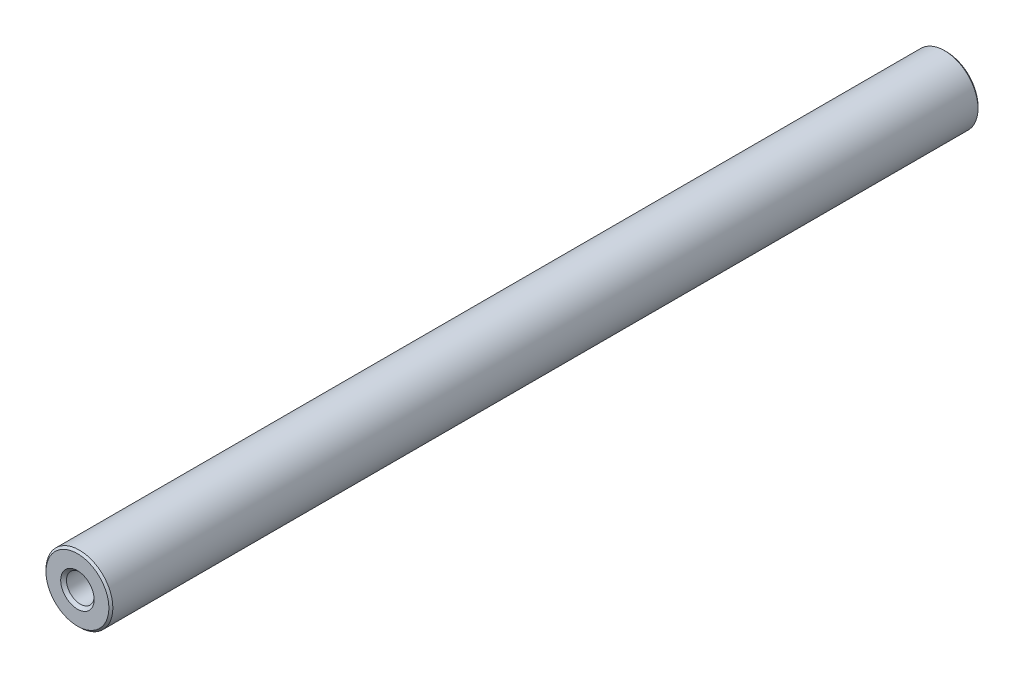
ISO-10303-21;
HEADER;
FILE_DESCRIPTION(('STEP AP214'),'2;1');
FILE_NAME('part.step','',(''),(''),'','','');
FILE_SCHEMA(('AUTOMOTIVE_DESIGN { 1 0 10303 214 1 1 1 1 }'));
ENDSEC;
DATA;
#1=APPLICATION_CONTEXT('core data for automotive mechanical design processes');
#2=APPLICATION_PROTOCOL_DEFINITION('international standard','automotive_design',2000,#1);
#3=PRODUCT_CONTEXT('',#1,'mechanical');
#4=PRODUCT('Part','Part','',(#3));
#5=PRODUCT_RELATED_PRODUCT_CATEGORY('part','',(#4));
#6=PRODUCT_DEFINITION_FORMATION('','',#4);
#7=PRODUCT_DEFINITION_CONTEXT('part definition',#1,'design');
#8=PRODUCT_DEFINITION('design','',#6,#7);
#9=PRODUCT_DEFINITION_SHAPE('','',#8);
#10=(LENGTH_UNIT() NAMED_UNIT(*) SI_UNIT(.MILLI.,.METRE.));
#11=(NAMED_UNIT(*) PLANE_ANGLE_UNIT() SI_UNIT($,.RADIAN.));
#12=(NAMED_UNIT(*) SI_UNIT($,.STERADIAN.) SOLID_ANGLE_UNIT());
#13=UNCERTAINTY_MEASURE_WITH_UNIT(LENGTH_MEASURE(1.E-05),#10,'distance_accuracy_value','');
#14=(GEOMETRIC_REPRESENTATION_CONTEXT(3) GLOBAL_UNCERTAINTY_ASSIGNED_CONTEXT((#13)) GLOBAL_UNIT_ASSIGNED_CONTEXT((#10,
#11,#12)) REPRESENTATION_CONTEXT('',''));
#15=CARTESIAN_POINT('',(0.,0.,0.));
#16=DIRECTION('',(0.,0.,1.));
#17=DIRECTION('',(1.,0.,0.));
#18=AXIS2_PLACEMENT_3D('',#15,#16,#17);
#19=CARTESIAN_POINT('',(0.,0.,-12.7499926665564));
#20=DIRECTION('',(0.,0.,1.));
#21=DIRECTION('',(1.,0.,0.));
#22=AXIS2_PLACEMENT_3D('',#19,#20,#21);
#23=CONICAL_SURFACE('',#22,2.06700000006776,1.04719755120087);
#24=CARTESIAN_POINT('',(5.6843418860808E-11,0.,-13.9433756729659));
#25=VERTEX_POINT('',#24);
#26=VERTEX_LOOP('',#25);
#27=FACE_BOUND('',#26,.T.);
#28=CARTESIAN_POINT('',(0.,0.,-12.7499926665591));
#29=DIRECTION('',(0.,0.,1.));
#30=DIRECTION('',(1.,0.,0.));
#31=AXIS2_PLACEMENT_3D('',#28,#29,#30);
#32=CIRCLE('',#31,2.067);
#33=CARTESIAN_POINT('',(2.067,0.,-12.7499926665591));
#34=VERTEX_POINT('',#33);
#35=EDGE_CURVE('E32',#34,#34,#32,.T.);
#36=ORIENTED_EDGE('',*,*,#35,.T.);
#37=EDGE_LOOP('',(#36));
#38=FACE_BOUND('',#37,.T.);
#39=ADVANCED_FACE('F16',(#27,#38),#23,.F.);
#40=CARTESIAN_POINT('',(0.,0.,-13.9433756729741));
#41=DIRECTION('',(0.,0.,1.));
#42=DIRECTION('',(1.,0.,0.));
#43=AXIS2_PLACEMENT_3D('',#40,#41,#42);
#44=CYLINDRICAL_SURFACE('',#43,2.067);
#45=CARTESIAN_POINT('',(0.,0.,-0.432999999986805));
#46=DIRECTION('',(0.,0.,1.));
#47=DIRECTION('',(1.,0.,0.));
#48=AXIS2_PLACEMENT_3D('',#45,#46,#47);
#49=CIRCLE('',#48,2.06699999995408);
#50=CARTESIAN_POINT('',(2.06699999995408,0.,-0.432999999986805));
#51=VERTEX_POINT('',#50);
#52=EDGE_CURVE('E34',#51,#51,#49,.T.);
#53=ORIENTED_EDGE('',*,*,#52,.T.);
#54=EDGE_LOOP('',(#53));
#55=FACE_BOUND('',#54,.T.);
#56=ORIENTED_EDGE('',*,*,#35,.F.);
#57=EDGE_LOOP('',(#56));
#58=FACE_BOUND('',#57,.T.);
#59=ADVANCED_FACE('F29',(#55,#58),#44,.F.);
#60=CARTESIAN_POINT('',(0.,0.,0.));
#61=DIRECTION('',(0.,0.,1.));
#62=DIRECTION('',(1.,0.,0.));
#63=AXIS2_PLACEMENT_3D('',#60,#61,#62);
#64=CONICAL_SURFACE('',#63,2.49999999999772,0.785398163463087);
#65=CARTESIAN_POINT('',(0.,0.,0.));
#66=DIRECTION('',(0.,0.,1.));
#67=DIRECTION('',(1.,0.,0.));
#68=AXIS2_PLACEMENT_3D('',#65,#66,#67);
#69=CIRCLE('',#68,2.49999999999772);
#70=CARTESIAN_POINT('',(2.49999999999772,0.,0.));
#71=VERTEX_POINT('',#70);
#72=EDGE_CURVE('E19',#71,#71,#69,.T.);
#73=ORIENTED_EDGE('',*,*,#72,.T.);
#74=EDGE_LOOP('',(#73));
#75=FACE_BOUND('',#74,.T.);
#76=ORIENTED_EDGE('',*,*,#52,.F.);
#77=EDGE_LOOP('',(#76));
#78=FACE_BOUND('',#77,.T.);
#79=ADVANCED_FACE('F52',(#75,#78),#64,.F.);
#80=CARTESIAN_POINT('',(0.,4.7,-130.));
#81=DIRECTION('',(0.,0.,1.));
#82=DIRECTION('',(1.,0.,0.));
#83=AXIS2_PLACEMENT_3D('',#80,#81,#82);
#84=PLANE('',#83);
#85=CARTESIAN_POINT('',(0.,0.,-129.999999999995));
#86=DIRECTION('',(0.,0.,1.));
#87=DIRECTION('',(1.,0.,0.));
#88=AXIS2_PLACEMENT_3D('',#85,#86,#87);
#89=CIRCLE('',#88,4.69999999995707);
#90=CARTESIAN_POINT('',(4.69999999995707,0.,-129.999999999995));
#91=VERTEX_POINT('',#90);
#92=EDGE_CURVE('E45',#91,#91,#89,.T.);
#93=ORIENTED_EDGE('',*,*,#92,.F.);
#94=EDGE_LOOP('',(#93));
#95=FACE_BOUND('',#94,.T.);
#96=ADVANCED_FACE('F59',(#95),#84,.F.);
#97=CARTESIAN_POINT('',(0.,0.,0.));
#98=DIRECTION('',(0.,0.,-1.));
#99=DIRECTION('',(-1.,0.,0.));
#100=AXIS2_PLACEMENT_3D('',#97,#98,#99);
#101=PLANE('',#100);
#102=ORIENTED_EDGE('',*,*,#72,.F.);
#103=EDGE_LOOP('',(#102));
#104=FACE_BOUND('',#103,.T.);
#105=CARTESIAN_POINT('',(0.,0.,0.));
#106=DIRECTION('',(0.,0.,-1.));
#107=DIRECTION('',(-1.,0.,0.));
#108=AXIS2_PLACEMENT_3D('',#105,#106,#107);
#109=CIRCLE('',#108,4.69999999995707);
#110=CARTESIAN_POINT('',(-4.69999999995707,0.,0.));
#111=VERTEX_POINT('',#110);
#112=EDGE_CURVE('E43',#111,#111,#109,.T.);
#113=ORIENTED_EDGE('',*,*,#112,.F.);
#114=EDGE_LOOP('',(#113));
#115=FACE_BOUND('',#114,.T.);
#116=ADVANCED_FACE('F55',(#104,#115),#101,.F.);
#117=CARTESIAN_POINT('',(0.,0.,-129.700000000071));
#118=DIRECTION('',(0.,0.,1.));
#119=DIRECTION('',(1.,0.,0.));
#120=AXIS2_PLACEMENT_3D('',#117,#118,#119);
#121=CONICAL_SURFACE('',#120,4.99999999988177,0.785398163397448);
#122=CARTESIAN_POINT('',(0.,0.,-129.7));
#123=DIRECTION('',(0.,0.,1.));
#124=DIRECTION('',(1.,0.,0.));
#125=AXIS2_PLACEMENT_3D('',#122,#123,#124);
#126=CIRCLE('',#125,5.);
#127=CARTESIAN_POINT('',(5.,0.,-129.7));
#128=VERTEX_POINT('',#127);
#129=EDGE_CURVE('E23',#128,#128,#126,.T.);
#130=ORIENTED_EDGE('',*,*,#129,.F.);
#131=EDGE_LOOP('',(#130));
#132=FACE_BOUND('',#131,.T.);
#133=ORIENTED_EDGE('',*,*,#92,.T.);
#134=EDGE_LOOP('',(#133));
#135=FACE_BOUND('',#134,.T.);
#136=ADVANCED_FACE('F58',(#132,#135),#121,.T.);
#137=CARTESIAN_POINT('',(0.,0.,-0.299999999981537));
#138=DIRECTION('',(0.,0.,-1.));
#139=DIRECTION('',(-1.,0.,0.));
#140=AXIS2_PLACEMENT_3D('',#137,#138,#139);
#141=CONICAL_SURFACE('',#140,4.99999999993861,0.785398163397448);
#142=ORIENTED_EDGE('',*,*,#112,.T.);
#143=EDGE_LOOP('',(#142));
#144=FACE_BOUND('',#143,.T.);
#145=CARTESIAN_POINT('',(0.,0.,-0.299999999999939));
#146=DIRECTION('',(0.,0.,1.));
#147=DIRECTION('',(1.,0.,0.));
#148=AXIS2_PLACEMENT_3D('',#145,#146,#147);
#149=CIRCLE('',#148,5.);
#150=CARTESIAN_POINT('',(5.,0.,-0.299999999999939));
#151=VERTEX_POINT('',#150);
#152=EDGE_CURVE('E11',#151,#151,#149,.F.);
#153=ORIENTED_EDGE('',*,*,#152,.F.);
#154=EDGE_LOOP('',(#153));
#155=FACE_BOUND('',#154,.T.);
#156=ADVANCED_FACE('F63',(#144,#155),#141,.T.);
#157=CARTESIAN_POINT('',(0.,0.,-130.));
#158=DIRECTION('',(0.,0.,1.));
#159=DIRECTION('',(1.,0.,0.));
#160=AXIS2_PLACEMENT_3D('',#157,#158,#159);
#161=CYLINDRICAL_SURFACE('',#160,5.);
#162=ORIENTED_EDGE('',*,*,#152,.T.);
#163=EDGE_LOOP('',(#162));
#164=FACE_BOUND('',#163,.T.);
#165=ORIENTED_EDGE('',*,*,#129,.T.);
#166=EDGE_LOOP('',(#165));
#167=FACE_BOUND('',#166,.T.);
#168=ADVANCED_FACE('F66',(#164,#167),#161,.T.);
#169=CLOSED_SHELL('',(#39,#59,#79,#96,#116,#136,#156,#168));
#170=MANIFOLD_SOLID_BREP('B1',#169);
#171=ADVANCED_BREP_SHAPE_REPRESENTATION('',(#18,#170),#14);
#172=SHAPE_DEFINITION_REPRESENTATION(#9,#171);
ENDSEC;
END-ISO-10303-21;
